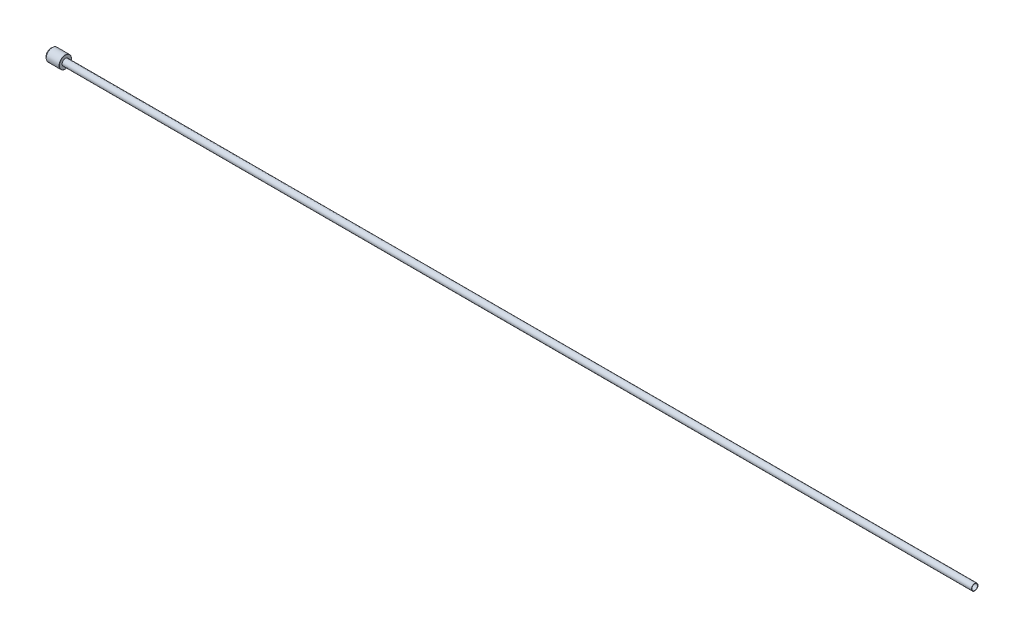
from build123d import *

# Parameters (mm, degrees)
FILLET3_R = 0.1


with BuildPart() as part:
    # Sketch1 → Revolve1 (revolve)
    with BuildSketch(Plane.XY, mode=Mode.PRIVATE) as revolve1_sk:
        Polygon((0.66, 3), (6, 3), (7, 3), (7, 1.5875), (450, 1.5875), (450, 1.3843), (0, 1.3843), (0, 2.44), (0.1, 2.44), align=None)
    revolve(revolve1_sk.sketch.rotate(Axis((-22.212185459, 0, 0), (1, 0, 0)), 90), axis=Axis((-22.212185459, 0, 0), (1, 0, 0)))

    # Fillet3
    fillet3_edges = [part.edges().sort_by_distance(p)[0] for p in [
        (7, 0, -3),
    ]]
    fillet(fillet3_edges, radius=FILLET3_R)


solid = part.part
